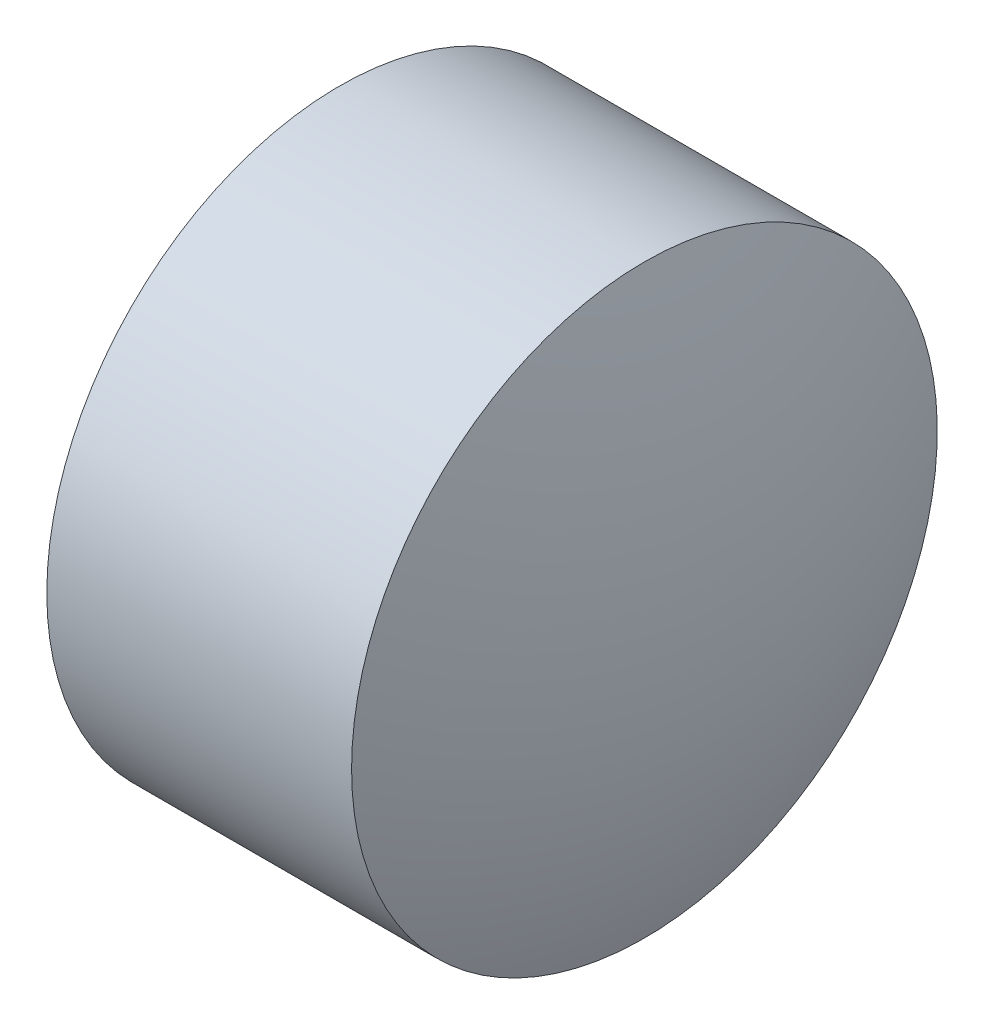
ISO-10303-21;
HEADER;
FILE_DESCRIPTION(('STEP AP214'),'2;1');
FILE_NAME('part.step','',(''),(''),'','','');
FILE_SCHEMA(('AUTOMOTIVE_DESIGN { 1 0 10303 214 1 1 1 1 }'));
ENDSEC;
DATA;
#1=APPLICATION_CONTEXT('core data for automotive mechanical design processes');
#2=APPLICATION_PROTOCOL_DEFINITION('international standard','automotive_design',2000,#1);
#3=PRODUCT_CONTEXT('',#1,'mechanical');
#4=PRODUCT('Part','Part','',(#3));
#5=PRODUCT_RELATED_PRODUCT_CATEGORY('part','',(#4));
#6=PRODUCT_DEFINITION_FORMATION('','',#4);
#7=PRODUCT_DEFINITION_CONTEXT('part definition',#1,'design');
#8=PRODUCT_DEFINITION('design','',#6,#7);
#9=PRODUCT_DEFINITION_SHAPE('','',#8);
#10=(LENGTH_UNIT() NAMED_UNIT(*) SI_UNIT(.MILLI.,.METRE.));
#11=(NAMED_UNIT(*) PLANE_ANGLE_UNIT() SI_UNIT($,.RADIAN.));
#12=(NAMED_UNIT(*) SI_UNIT($,.STERADIAN.) SOLID_ANGLE_UNIT());
#13=UNCERTAINTY_MEASURE_WITH_UNIT(LENGTH_MEASURE(1.E-05),#10,'distance_accuracy_value','');
#14=(GEOMETRIC_REPRESENTATION_CONTEXT(3) GLOBAL_UNCERTAINTY_ASSIGNED_CONTEXT((#13)) GLOBAL_UNIT_ASSIGNED_CONTEXT((#10,
#11,#12)) REPRESENTATION_CONTEXT('',''));
#15=CARTESIAN_POINT('',(0.,0.,0.));
#16=DIRECTION('',(0.,0.,1.));
#17=DIRECTION('',(1.,0.,0.));
#18=AXIS2_PLACEMENT_3D('',#15,#16,#17);
#19=CARTESIAN_POINT('',(0.,0.,0.));
#20=DIRECTION('',(-1.,0.,0.));
#21=DIRECTION('',(0.,0.,1.));
#22=AXIS2_PLACEMENT_3D('',#19,#20,#21);
#23=CYLINDRICAL_SURFACE('',#22,1.5);
#24=CARTESIAN_POINT('',(1.72300904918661,0.,0.));
#25=DIRECTION('',(-1.,0.,0.));
#26=DIRECTION('',(0.,0.,1.));
#27=AXIS2_PLACEMENT_3D('',#24,#25,#26);
#28=CIRCLE('',#27,1.5);
#29=CARTESIAN_POINT('',(1.72300904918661,0.,1.5));
#30=VERTEX_POINT('',#29);
#31=EDGE_CURVE('E11',#30,#30,#28,.T.);
#32=ORIENTED_EDGE('',*,*,#31,.T.);
#33=EDGE_LOOP('',(#32));
#34=FACE_BOUND('',#33,.T.);
#35=CARTESIAN_POINT('',(0.16194675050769,0.,0.));
#36=DIRECTION('',(-1.,0.,0.));
#37=DIRECTION('',(0.,0.,1.));
#38=AXIS2_PLACEMENT_3D('',#35,#36,#37);
#39=CIRCLE('',#38,1.5);
#40=CARTESIAN_POINT('',(0.16194675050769,0.,1.5));
#41=VERTEX_POINT('',#40);
#42=EDGE_CURVE('E40',#41,#41,#39,.T.);
#43=ORIENTED_EDGE('',*,*,#42,.F.);
#44=EDGE_LOOP('',(#43));
#45=FACE_BOUND('',#44,.T.);
#46=ADVANCED_FACE('F32',(#34,#45),#23,.T.);
#47=CARTESIAN_POINT('',(-2.19999999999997,0.,0.));
#48=DIRECTION('',(-1.,0.,0.));
#49=DIRECTION('',(0.,1.,0.));
#50=AXIS2_PLACEMENT_3D('',#47,#48,#49);
#51=SPHERICAL_SURFACE('',#50,4.19999999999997);
#52=ORIENTED_EDGE('',*,*,#31,.F.);
#53=EDGE_LOOP('',(#52));
#54=FACE_BOUND('',#53,.T.);
#55=ADVANCED_FACE('F34',(#54),#51,.T.);
#56=CARTESIAN_POINT('',(0.,0.,0.));
#57=DIRECTION('',(1.,0.,0.));
#58=DIRECTION('',(0.,0.,-1.));
#59=AXIS2_PLACEMENT_3D('',#56,#57,#58);
#60=CONICAL_SURFACE('',#59,1.2195,1.0471975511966);
#61=ORIENTED_EDGE('',*,*,#42,.T.);
#62=EDGE_LOOP('',(#61));
#63=FACE_BOUND('',#62,.T.);
#64=CARTESIAN_POINT('',(0.,0.,0.));
#65=DIRECTION('',(-1.,0.,0.));
#66=DIRECTION('',(0.,0.,1.));
#67=AXIS2_PLACEMENT_3D('',#64,#65,#66);
#68=CIRCLE('',#67,1.2195);
#69=CARTESIAN_POINT('',(0.,0.,1.2195));
#70=VERTEX_POINT('',#69);
#71=EDGE_CURVE('E134',#70,#70,#68,.T.);
#72=ORIENTED_EDGE('',*,*,#71,.F.);
#73=EDGE_LOOP('',(#72));
#74=FACE_BOUND('',#73,.T.);
#75=ADVANCED_FACE('F144',(#63,#74),#60,.T.);
#76=CARTESIAN_POINT('',(0.,1.5,0.));
#77=DIRECTION('',(1.,0.,0.));
#78=DIRECTION('',(0.,0.,-1.));
#79=AXIS2_PLACEMENT_3D('',#76,#77,#78);
#80=PLANE('',#79);
#81=DIRECTION('',(0.,-0.5,-0.866025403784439));
#82=VECTOR('',#81,1.);
#83=CARTESIAN_POINT('',(0.,0.866025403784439,0.));
#84=LINE('',#83,#82);
#85=CARTESIAN_POINT('',(0.,0.866025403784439,0.));
#86=VERTEX_POINT('',#85);
#87=CARTESIAN_POINT('',(0.,0.43301270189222,-0.75));
#88=VERTEX_POINT('',#87);
#89=EDGE_CURVE('E121',#86,#88,#84,.T.);
#90=ORIENTED_EDGE('',*,*,#89,.F.);
#91=DIRECTION('',(0.,0.5,-0.866025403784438));
#92=VECTOR('',#91,1.);
#93=CARTESIAN_POINT('',(0.,0.43301270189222,0.75));
#94=LINE('',#93,#92);
#95=CARTESIAN_POINT('',(0.,0.43301270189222,0.75));
#96=VERTEX_POINT('',#95);
#97=EDGE_CURVE('E47',#96,#86,#94,.T.);
#98=ORIENTED_EDGE('',*,*,#97,.F.);
#99=DIRECTION('',(0.,1.,0.));
#100=VECTOR('',#99,1.);
#101=CARTESIAN_POINT('',(0.,-0.43301270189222,0.75));
#102=LINE('',#101,#100);
#103=CARTESIAN_POINT('',(0.,-0.43301270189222,0.75));
#104=VERTEX_POINT('',#103);
#105=EDGE_CURVE('E130',#104,#96,#102,.T.);
#106=ORIENTED_EDGE('',*,*,#105,.F.);
#107=DIRECTION('',(0.,0.5,0.866025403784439));
#108=VECTOR('',#107,1.);
#109=CARTESIAN_POINT('',(0.,-0.866025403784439,0.));
#110=LINE('',#109,#108);
#111=CARTESIAN_POINT('',(0.,-0.866025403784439,0.));
#112=VERTEX_POINT('',#111);
#113=EDGE_CURVE('E128',#112,#104,#110,.T.);
#114=ORIENTED_EDGE('',*,*,#113,.F.);
#115=DIRECTION('',(0.,-0.5,0.866025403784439));
#116=VECTOR('',#115,1.);
#117=CARTESIAN_POINT('',(0.,-0.433012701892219,-0.75));
#118=LINE('',#117,#116);
#119=CARTESIAN_POINT('',(0.,-0.433012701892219,-0.75));
#120=VERTEX_POINT('',#119);
#121=EDGE_CURVE('E95',#120,#112,#118,.T.);
#122=ORIENTED_EDGE('',*,*,#121,.F.);
#123=DIRECTION('',(0.,-1.,0.));
#124=VECTOR('',#123,1.);
#125=CARTESIAN_POINT('',(0.,0.43301270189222,-0.75));
#126=LINE('',#125,#124);
#127=EDGE_CURVE('E124',#88,#120,#126,.T.);
#128=ORIENTED_EDGE('',*,*,#127,.F.);
#129=EDGE_LOOP('',(#90,#98,#106,#114,#122,#128));
#130=FACE_BOUND('',#129,.T.);
#131=ORIENTED_EDGE('',*,*,#71,.T.);
#132=EDGE_LOOP('',(#131));
#133=FACE_BOUND('',#132,.T.);
#134=ADVANCED_FACE('F154',(#130,#133),#80,.F.);
#135=CARTESIAN_POINT('',(1.2,0.43301270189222,0.75));
#136=DIRECTION('',(0.,0.866025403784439,0.5));
#137=DIRECTION('',(0.,-0.5,0.866025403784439));
#138=AXIS2_PLACEMENT_3D('',#135,#136,#137);
#139=PLANE('',#138);
#140=ORIENTED_EDGE('',*,*,#97,.T.);
#141=DIRECTION('',(-1.,0.,0.));
#142=VECTOR('',#141,1.);
#143=CARTESIAN_POINT('',(1.2,0.866025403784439,0.));
#144=LINE('',#143,#142);
#145=CARTESIAN_POINT('',(1.2,0.866025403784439,0.));
#146=VERTEX_POINT('',#145);
#147=EDGE_CURVE('E77',#146,#86,#144,.T.);
#148=ORIENTED_EDGE('',*,*,#147,.F.);
#149=DIRECTION('',(0.,0.5,-0.866025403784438));
#150=VECTOR('',#149,1.);
#151=CARTESIAN_POINT('',(1.2,0.43301270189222,0.75));
#152=LINE('',#151,#150);
#153=CARTESIAN_POINT('',(1.2,0.43301270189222,0.75));
#154=VERTEX_POINT('',#153);
#155=EDGE_CURVE('E132',#154,#146,#152,.T.);
#156=ORIENTED_EDGE('',*,*,#155,.F.);
#157=DIRECTION('',(-1.,0.,0.));
#158=VECTOR('',#157,1.);
#159=CARTESIAN_POINT('',(1.2,0.43301270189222,0.75));
#160=LINE('',#159,#158);
#161=EDGE_CURVE('E55',#154,#96,#160,.T.);
#162=ORIENTED_EDGE('',*,*,#161,.T.);
#163=EDGE_LOOP('',(#140,#148,#156,#162));
#164=FACE_BOUND('',#163,.T.);
#165=ADVANCED_FACE('F157',(#164),#139,.F.);
#166=CARTESIAN_POINT('',(1.2,-0.43301270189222,0.75));
#167=DIRECTION('',(0.,0.,1.));
#168=DIRECTION('',(1.,0.,0.));
#169=AXIS2_PLACEMENT_3D('',#166,#167,#168);
#170=PLANE('',#169);
#171=ORIENTED_EDGE('',*,*,#105,.T.);
#172=ORIENTED_EDGE('',*,*,#161,.F.);
#173=DIRECTION('',(0.,1.,0.));
#174=VECTOR('',#173,1.);
#175=CARTESIAN_POINT('',(1.2,-0.43301270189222,0.75));
#176=LINE('',#175,#174);
#177=CARTESIAN_POINT('',(1.2,-0.43301270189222,0.75));
#178=VERTEX_POINT('',#177);
#179=EDGE_CURVE('E107',#178,#154,#176,.T.);
#180=ORIENTED_EDGE('',*,*,#179,.F.);
#181=DIRECTION('',(-1.,0.,0.));
#182=VECTOR('',#181,1.);
#183=CARTESIAN_POINT('',(1.2,-0.43301270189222,0.75));
#184=LINE('',#183,#182);
#185=EDGE_CURVE('E99',#178,#104,#184,.T.);
#186=ORIENTED_EDGE('',*,*,#185,.T.);
#187=EDGE_LOOP('',(#171,#172,#180,#186));
#188=FACE_BOUND('',#187,.T.);
#189=ADVANCED_FACE('F163',(#188),#170,.F.);
#190=CARTESIAN_POINT('',(1.2,-0.866025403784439,0.));
#191=DIRECTION('',(0.,-0.866025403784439,0.5));
#192=DIRECTION('',(0.,-0.5,-0.866025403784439));
#193=AXIS2_PLACEMENT_3D('',#190,#191,#192);
#194=PLANE('',#193);
#195=ORIENTED_EDGE('',*,*,#113,.T.);
#196=ORIENTED_EDGE('',*,*,#185,.F.);
#197=DIRECTION('',(0.,0.5,0.866025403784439));
#198=VECTOR('',#197,1.);
#199=CARTESIAN_POINT('',(1.2,-0.866025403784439,0.));
#200=LINE('',#199,#198);
#201=CARTESIAN_POINT('',(1.2,-0.866025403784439,0.));
#202=VERTEX_POINT('',#201);
#203=EDGE_CURVE('E103',#202,#178,#200,.T.);
#204=ORIENTED_EDGE('',*,*,#203,.F.);
#205=DIRECTION('',(-1.,0.,0.));
#206=VECTOR('',#205,1.);
#207=CARTESIAN_POINT('',(1.2,-0.866025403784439,0.));
#208=LINE('',#207,#206);
#209=EDGE_CURVE('E88',#202,#112,#208,.T.);
#210=ORIENTED_EDGE('',*,*,#209,.T.);
#211=EDGE_LOOP('',(#195,#196,#204,#210));
#212=FACE_BOUND('',#211,.T.);
#213=ADVANCED_FACE('F104',(#212),#194,.F.);
#214=CARTESIAN_POINT('',(1.2,-0.433012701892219,-0.75));
#215=DIRECTION('',(0.,-0.866025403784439,-0.5));
#216=DIRECTION('',(0.,0.5,-0.866025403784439));
#217=AXIS2_PLACEMENT_3D('',#214,#215,#216);
#218=PLANE('',#217);
#219=ORIENTED_EDGE('',*,*,#121,.T.);
#220=ORIENTED_EDGE('',*,*,#209,.F.);
#221=DIRECTION('',(0.,-0.5,0.866025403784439));
#222=VECTOR('',#221,1.);
#223=CARTESIAN_POINT('',(1.2,-0.433012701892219,-0.75));
#224=LINE('',#223,#222);
#225=CARTESIAN_POINT('',(1.2,-0.433012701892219,-0.75));
#226=VERTEX_POINT('',#225);
#227=EDGE_CURVE('E92',#226,#202,#224,.T.);
#228=ORIENTED_EDGE('',*,*,#227,.F.);
#229=DIRECTION('',(-1.,0.,0.));
#230=VECTOR('',#229,1.);
#231=CARTESIAN_POINT('',(1.2,-0.433012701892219,-0.75));
#232=LINE('',#231,#230);
#233=EDGE_CURVE('E100',#226,#120,#232,.T.);
#234=ORIENTED_EDGE('',*,*,#233,.T.);
#235=EDGE_LOOP('',(#219,#220,#228,#234));
#236=FACE_BOUND('',#235,.T.);
#237=ADVANCED_FACE('F90',(#236),#218,.F.);
#238=CARTESIAN_POINT('',(1.2,0.43301270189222,-0.75));
#239=DIRECTION('',(0.,0.,-1.));
#240=DIRECTION('',(-1.,0.,0.));
#241=AXIS2_PLACEMENT_3D('',#238,#239,#240);
#242=PLANE('',#241);
#243=ORIENTED_EDGE('',*,*,#127,.T.);
#244=ORIENTED_EDGE('',*,*,#233,.F.);
#245=DIRECTION('',(0.,-1.,0.));
#246=VECTOR('',#245,1.);
#247=CARTESIAN_POINT('',(1.2,0.43301270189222,-0.75));
#248=LINE('',#247,#246);
#249=CARTESIAN_POINT('',(1.2,0.43301270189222,-0.75));
#250=VERTEX_POINT('',#249);
#251=EDGE_CURVE('E113',#250,#226,#248,.T.);
#252=ORIENTED_EDGE('',*,*,#251,.F.);
#253=DIRECTION('',(-1.,0.,0.));
#254=VECTOR('',#253,1.);
#255=CARTESIAN_POINT('',(1.2,0.43301270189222,-0.75));
#256=LINE('',#255,#254);
#257=EDGE_CURVE('E137',#250,#88,#256,.T.);
#258=ORIENTED_EDGE('',*,*,#257,.T.);
#259=EDGE_LOOP('',(#243,#244,#252,#258));
#260=FACE_BOUND('',#259,.T.);
#261=ADVANCED_FACE('F167',(#260),#242,.F.);
#262=CARTESIAN_POINT('',(1.2,0.866025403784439,0.));
#263=DIRECTION('',(0.,0.866025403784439,-0.5));
#264=DIRECTION('',(0.,0.5,0.866025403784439));
#265=AXIS2_PLACEMENT_3D('',#262,#263,#264);
#266=PLANE('',#265);
#267=ORIENTED_EDGE('',*,*,#89,.T.);
#268=ORIENTED_EDGE('',*,*,#257,.F.);
#269=DIRECTION('',(0.,-0.5,-0.866025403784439));
#270=VECTOR('',#269,1.);
#271=CARTESIAN_POINT('',(1.2,0.866025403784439,0.));
#272=LINE('',#271,#270);
#273=EDGE_CURVE('E115',#146,#250,#272,.T.);
#274=ORIENTED_EDGE('',*,*,#273,.F.);
#275=ORIENTED_EDGE('',*,*,#147,.T.);
#276=EDGE_LOOP('',(#267,#268,#274,#275));
#277=FACE_BOUND('',#276,.T.);
#278=ADVANCED_FACE('F164',(#277),#266,.F.);
#279=CARTESIAN_POINT('',(1.2,0.866025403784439,0.));
#280=DIRECTION('',(-1.,0.,0.));
#281=DIRECTION('',(0.,0.,1.));
#282=AXIS2_PLACEMENT_3D('',#279,#280,#281);
#283=PLANE('',#282);
#284=ORIENTED_EDGE('',*,*,#155,.T.);
#285=ORIENTED_EDGE('',*,*,#273,.T.);
#286=ORIENTED_EDGE('',*,*,#251,.T.);
#287=ORIENTED_EDGE('',*,*,#227,.T.);
#288=ORIENTED_EDGE('',*,*,#203,.T.);
#289=ORIENTED_EDGE('',*,*,#179,.T.);
#290=EDGE_LOOP('',(#284,#285,#286,#287,#288,#289));
#291=FACE_BOUND('',#290,.T.);
#292=ADVANCED_FACE('F110',(#291),#283,.T.);
#293=CLOSED_SHELL('',(#46,#55,#75,#134,#165,#189,#213,#237,#261,#278,#292));
#294=MANIFOLD_SOLID_BREP('B2',#293);
#295=ADVANCED_BREP_SHAPE_REPRESENTATION('',(#18,#294),#14);
#296=SHAPE_DEFINITION_REPRESENTATION(#9,#295);
ENDSEC;
END-ISO-10303-21;
